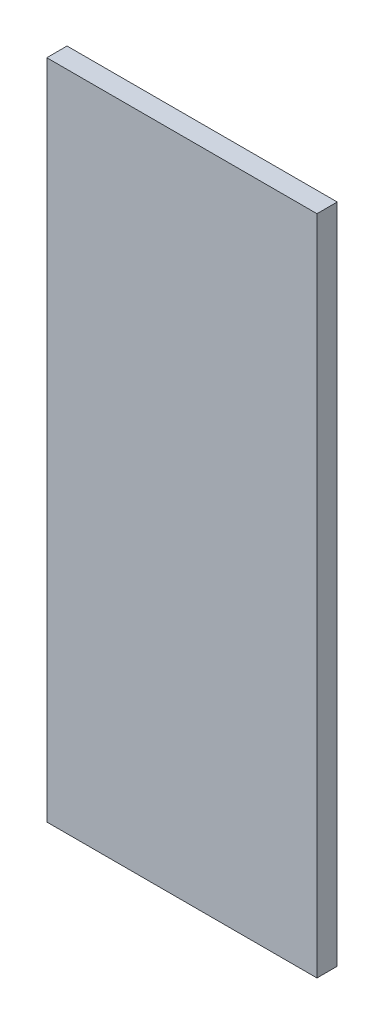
ISO-10303-21;
HEADER;
FILE_DESCRIPTION(('STEP AP214'),'2;1');
FILE_NAME('part.step','',(''),(''),'','','');
FILE_SCHEMA(('AUTOMOTIVE_DESIGN { 1 0 10303 214 1 1 1 1 }'));
ENDSEC;
DATA;
#1=APPLICATION_CONTEXT('core data for automotive mechanical design processes');
#2=APPLICATION_PROTOCOL_DEFINITION('international standard','automotive_design',2000,#1);
#3=PRODUCT_CONTEXT('',#1,'mechanical');
#4=PRODUCT('Part','Part','',(#3));
#5=PRODUCT_RELATED_PRODUCT_CATEGORY('part','',(#4));
#6=PRODUCT_DEFINITION_FORMATION('','',#4);
#7=PRODUCT_DEFINITION_CONTEXT('part definition',#1,'design');
#8=PRODUCT_DEFINITION('design','',#6,#7);
#9=PRODUCT_DEFINITION_SHAPE('','',#8);
#10=(LENGTH_UNIT() NAMED_UNIT(*) SI_UNIT(.MILLI.,.METRE.));
#11=(NAMED_UNIT(*) PLANE_ANGLE_UNIT() SI_UNIT($,.RADIAN.));
#12=(NAMED_UNIT(*) SI_UNIT($,.STERADIAN.) SOLID_ANGLE_UNIT());
#13=UNCERTAINTY_MEASURE_WITH_UNIT(LENGTH_MEASURE(1.E-05),#10,'distance_accuracy_value','');
#14=(GEOMETRIC_REPRESENTATION_CONTEXT(3) GLOBAL_UNCERTAINTY_ASSIGNED_CONTEXT((#13)) GLOBAL_UNIT_ASSIGNED_CONTEXT((#10,
#11,#12)) REPRESENTATION_CONTEXT('',''));
#15=CARTESIAN_POINT('',(0.,0.,0.));
#16=DIRECTION('',(0.,0.,1.));
#17=DIRECTION('',(1.,0.,0.));
#18=AXIS2_PLACEMENT_3D('',#15,#16,#17);
#19=CARTESIAN_POINT('',(0.,0.,3.));
#20=DIRECTION('',(1.,0.,0.));
#21=DIRECTION('',(0.,0.,-1.));
#22=AXIS2_PLACEMENT_3D('',#19,#20,#21);
#23=PLANE('',#22);
#24=DIRECTION('',(0.,-1.,0.));
#25=VECTOR('',#24,1.);
#26=CARTESIAN_POINT('',(0.,0.,0.));
#27=LINE('',#26,#25);
#28=CARTESIAN_POINT('',(0.,98.,0.));
#29=VERTEX_POINT('',#28);
#30=CARTESIAN_POINT('',(0.,0.,0.));
#31=VERTEX_POINT('',#30);
#32=EDGE_CURVE('E96',#29,#31,#27,.T.);
#33=ORIENTED_EDGE('',*,*,#32,.T.);
#34=DIRECTION('',(0.,0.,-1.));
#35=VECTOR('',#34,1.);
#36=CARTESIAN_POINT('',(0.,0.,3.));
#37=LINE('',#36,#35);
#38=CARTESIAN_POINT('',(0.,0.,3.));
#39=VERTEX_POINT('',#38);
#40=EDGE_CURVE('E11',#39,#31,#37,.T.);
#41=ORIENTED_EDGE('',*,*,#40,.F.);
#42=DIRECTION('',(0.,-1.,0.));
#43=VECTOR('',#42,1.);
#44=CARTESIAN_POINT('',(0.,0.,3.));
#45=LINE('',#44,#43);
#46=CARTESIAN_POINT('',(0.,98.,3.));
#47=VERTEX_POINT('',#46);
#48=EDGE_CURVE('E84',#47,#39,#45,.T.);
#49=ORIENTED_EDGE('',*,*,#48,.F.);
#50=DIRECTION('',(0.,0.,-1.));
#51=VECTOR('',#50,1.);
#52=CARTESIAN_POINT('',(0.,98.,3.));
#53=LINE('',#52,#51);
#54=EDGE_CURVE('E92',#47,#29,#53,.T.);
#55=ORIENTED_EDGE('',*,*,#54,.T.);
#56=EDGE_LOOP('',(#33,#41,#49,#55));
#57=FACE_BOUND('',#56,.T.);
#58=ADVANCED_FACE('F33',(#57),#23,.F.);
#59=CARTESIAN_POINT('',(0.,0.,3.));
#60=DIRECTION('',(0.,1.,0.));
#61=DIRECTION('',(0.,0.,1.));
#62=AXIS2_PLACEMENT_3D('',#59,#60,#61);
#63=PLANE('',#62);
#64=DIRECTION('',(1.,0.,0.));
#65=VECTOR('',#64,1.);
#66=CARTESIAN_POINT('',(0.,0.,0.));
#67=LINE('',#66,#65);
#68=CARTESIAN_POINT('',(40.,0.,0.));
#69=VERTEX_POINT('',#68);
#70=EDGE_CURVE('E88',#31,#69,#67,.T.);
#71=ORIENTED_EDGE('',*,*,#70,.T.);
#72=DIRECTION('',(0.,0.,-1.));
#73=VECTOR('',#72,1.);
#74=CARTESIAN_POINT('',(40.,0.,3.));
#75=LINE('',#74,#73);
#76=CARTESIAN_POINT('',(40.,0.,3.));
#77=VERTEX_POINT('',#76);
#78=EDGE_CURVE('E41',#77,#69,#75,.T.);
#79=ORIENTED_EDGE('',*,*,#78,.F.);
#80=DIRECTION('',(1.,0.,0.));
#81=VECTOR('',#80,1.);
#82=CARTESIAN_POINT('',(0.,0.,3.));
#83=LINE('',#82,#81);
#84=EDGE_CURVE('E79',#39,#77,#83,.T.);
#85=ORIENTED_EDGE('',*,*,#84,.F.);
#86=ORIENTED_EDGE('',*,*,#40,.T.);
#87=EDGE_LOOP('',(#71,#79,#85,#86));
#88=FACE_BOUND('',#87,.T.);
#89=ADVANCED_FACE('F87',(#88),#63,.F.);
#90=CARTESIAN_POINT('',(40.,0.,3.));
#91=DIRECTION('',(-1.,0.,0.));
#92=DIRECTION('',(0.,0.,1.));
#93=AXIS2_PLACEMENT_3D('',#90,#91,#92);
#94=PLANE('',#93);
#95=DIRECTION('',(0.,1.,0.));
#96=VECTOR('',#95,1.);
#97=CARTESIAN_POINT('',(40.,0.,0.));
#98=LINE('',#97,#96);
#99=CARTESIAN_POINT('',(40.,98.,0.));
#100=VERTEX_POINT('',#99);
#101=EDGE_CURVE('E66',#69,#100,#98,.T.);
#102=ORIENTED_EDGE('',*,*,#101,.T.);
#103=DIRECTION('',(0.,0.,-1.));
#104=VECTOR('',#103,1.);
#105=CARTESIAN_POINT('',(40.,98.,3.));
#106=LINE('',#105,#104);
#107=CARTESIAN_POINT('',(40.,98.,3.));
#108=VERTEX_POINT('',#107);
#109=EDGE_CURVE('E89',#108,#100,#106,.T.);
#110=ORIENTED_EDGE('',*,*,#109,.F.);
#111=DIRECTION('',(0.,1.,0.));
#112=VECTOR('',#111,1.);
#113=CARTESIAN_POINT('',(40.,0.,3.));
#114=LINE('',#113,#112);
#115=EDGE_CURVE('E82',#77,#108,#114,.T.);
#116=ORIENTED_EDGE('',*,*,#115,.F.);
#117=ORIENTED_EDGE('',*,*,#78,.T.);
#118=EDGE_LOOP('',(#102,#110,#116,#117));
#119=FACE_BOUND('',#118,.T.);
#120=ADVANCED_FACE('F90',(#119),#94,.F.);
#121=CARTESIAN_POINT('',(0.,98.,3.));
#122=DIRECTION('',(0.,-1.,0.));
#123=DIRECTION('',(0.,0.,-1.));
#124=AXIS2_PLACEMENT_3D('',#121,#122,#123);
#125=PLANE('',#124);
#126=DIRECTION('',(-1.,0.,0.));
#127=VECTOR('',#126,1.);
#128=CARTESIAN_POINT('',(0.,98.,0.));
#129=LINE('',#128,#127);
#130=EDGE_CURVE('E72',#100,#29,#129,.T.);
#131=ORIENTED_EDGE('',*,*,#130,.T.);
#132=ORIENTED_EDGE('',*,*,#54,.F.);
#133=DIRECTION('',(-1.,0.,0.));
#134=VECTOR('',#133,1.);
#135=CARTESIAN_POINT('',(0.,98.,3.));
#136=LINE('',#135,#134);
#137=EDGE_CURVE('E49',#108,#47,#136,.T.);
#138=ORIENTED_EDGE('',*,*,#137,.F.);
#139=ORIENTED_EDGE('',*,*,#109,.T.);
#140=EDGE_LOOP('',(#131,#132,#138,#139));
#141=FACE_BOUND('',#140,.T.);
#142=ADVANCED_FACE('F103',(#141),#125,.F.);
#143=CARTESIAN_POINT('',(0.,0.,3.));
#144=DIRECTION('',(0.,0.,-1.));
#145=DIRECTION('',(-1.,0.,0.));
#146=AXIS2_PLACEMENT_3D('',#143,#144,#145);
#147=PLANE('',#146);
#148=ORIENTED_EDGE('',*,*,#48,.T.);
#149=ORIENTED_EDGE('',*,*,#84,.T.);
#150=ORIENTED_EDGE('',*,*,#115,.T.);
#151=ORIENTED_EDGE('',*,*,#137,.T.);
#152=EDGE_LOOP('',(#148,#149,#150,#151));
#153=FACE_BOUND('',#152,.T.);
#154=ADVANCED_FACE('F80',(#153),#147,.F.);
#155=CARTESIAN_POINT('',(0.,0.,0.));
#156=DIRECTION('',(0.,0.,-1.));
#157=DIRECTION('',(-1.,0.,0.));
#158=AXIS2_PLACEMENT_3D('',#155,#156,#157);
#159=PLANE('',#158);
#160=ORIENTED_EDGE('',*,*,#32,.F.);
#161=ORIENTED_EDGE('',*,*,#130,.F.);
#162=ORIENTED_EDGE('',*,*,#101,.F.);
#163=ORIENTED_EDGE('',*,*,#70,.F.);
#164=EDGE_LOOP('',(#160,#161,#162,#163));
#165=FACE_BOUND('',#164,.T.);
#166=ADVANCED_FACE('F106',(#165),#159,.T.);
#167=CLOSED_SHELL('',(#58,#89,#120,#142,#154,#166));
#168=MANIFOLD_SOLID_BREP('B2',#167);
#169=ADVANCED_BREP_SHAPE_REPRESENTATION('',(#18,#168),#14);
#170=SHAPE_DEFINITION_REPRESENTATION(#9,#169);
ENDSEC;
END-ISO-10303-21;
